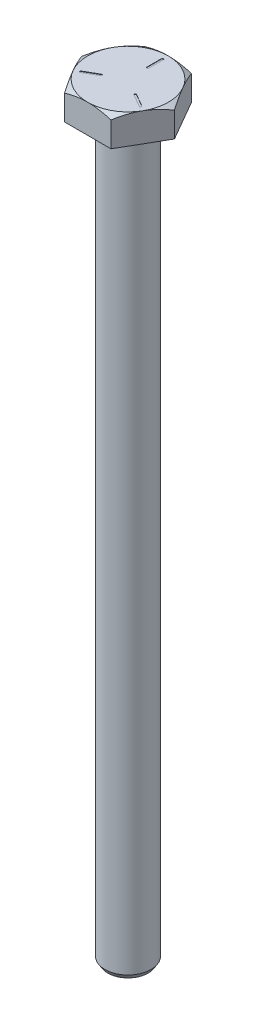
from build123d import *

# Parameters (mm, degrees)
BOSS_EXTRUDE1_DEPTH = 3.9624
CUT_EXTRUDE1_DEPTH  = 0.0508


with BuildPart() as part:
    # Sketch1 → Boss-Extrude1 (new body)
    with BuildSketch(Plane(origin=(0, 0, 0), x_dir=(1, 0, 0), z_dir=(0, 1, 0))):
        Polygon((6.415804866, 0), (3.207902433, 5.55625), (-3.207902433, 5.55625), (-6.415804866, 0), (-3.207902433, -5.55625), (3.207902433, -5.55625), align=None)
    extrude(amount=BOSS_EXTRUDE1_DEPTH)

    # Sketch2 → Cut-Revolve1 (revolve, cut)
    with BuildSketch(Plane.XY):
        Polygon((5.55625, 3.9624), (6.415804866, 3.4544), (6.415804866, 3.9624), align=None)
    revolve(axis=Axis((0, 0, 0), (0, 1, 0)), mode=Mode.SUBTRACT)

    # Sketch3 → Cut-Extrude1 (cut)
    with BuildSketch(Plane(origin=(0, 3.9624, 0), x_dir=(-1, 0, 0), z_dir=(0, -1, 0))):
        with BuildLine():
            Line((0.127, 4.7625), (0.127, 2.7305))
            ThreePointArc((0.127, 2.7305), (0, 2.6035), (-0.127, 2.7305))
            Line((-0.127, 2.7305), (-0.127, 4.7625))
            ThreePointArc((-0.127, 4.7625), (0, 4.8895), (0.127, 4.7625))
        make_face()
        with BuildLine():
            Line((4.060945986, -2.491235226), (2.301182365, -1.475235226))
            ThreePointArc((2.301182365, -1.475235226), (2.254697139, -1.30175), (2.428182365, -1.255264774))
            Line((2.428182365, -1.255264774), (4.187945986, -2.271264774))
            ThreePointArc((4.187945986, -2.271264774), (4.234431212, -2.44475), (4.060945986, -2.491235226))
        make_face()
        with BuildLine():
            Line((-4.187945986, -2.271264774), (-2.428182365, -1.255264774))
            ThreePointArc((-2.428182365, -1.255264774), (-2.254697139, -1.30175), (-2.301182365, -1.475235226))
            Line((-2.301182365, -1.475235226), (-4.060945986, -2.491235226))
            ThreePointArc((-4.060945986, -2.491235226), (-4.234431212, -2.44475), (-4.187945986, -2.271264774))
        make_face()
    extrude(amount=CUT_EXTRUDE1_DEPTH, mode=Mode.SUBTRACT)

    # Bolt Length Sketch → Bolt Length (revolve)
    with BuildSketch(Plane.XY, mode=Mode.PRIVATE) as bolt_length_sk:
        Polygon((0, 0), (0, -101.6), (2.778125, -101.6), (3.175, -100.965), (3.175, 0), align=None)
    revolve(bolt_length_sk.sketch.rotate(Axis((0, 0, 0), (0, -1, 0)), 180), axis=Axis((0, 0, 0), (0, -1, 0)))


solid = part.part
